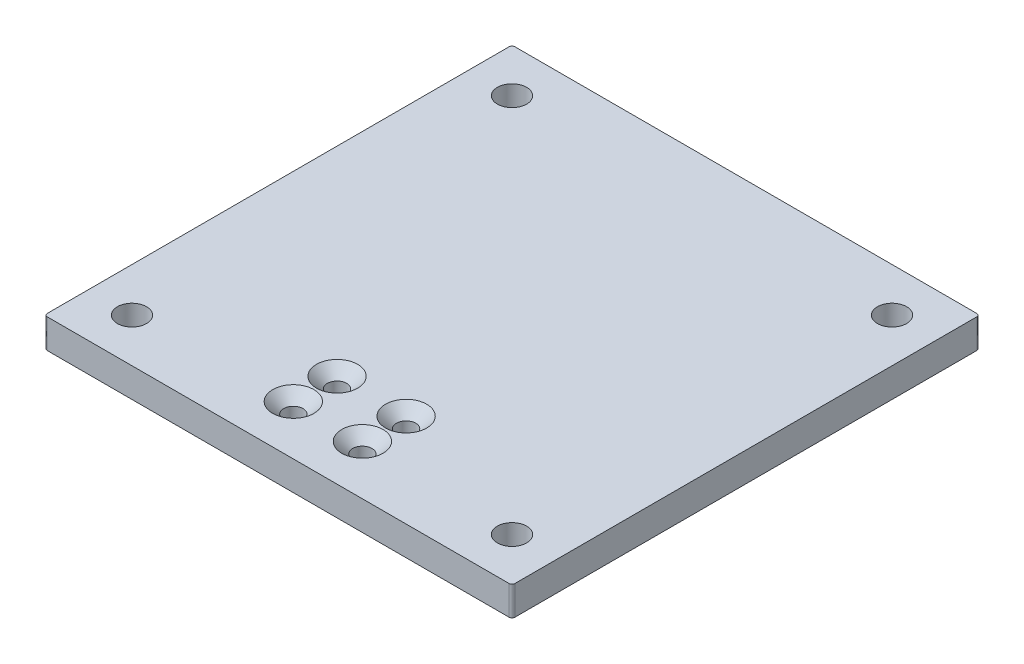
ISO-10303-21;
HEADER;
FILE_DESCRIPTION(('STEP AP214'),'2;1');
FILE_NAME('part.step','',(''),(''),'','','');
FILE_SCHEMA(('AUTOMOTIVE_DESIGN { 1 0 10303 214 1 1 1 1 }'));
ENDSEC;
DATA;
#1=APPLICATION_CONTEXT('core data for automotive mechanical design processes');
#2=APPLICATION_PROTOCOL_DEFINITION('international standard','automotive_design',2000,#1);
#3=PRODUCT_CONTEXT('',#1,'mechanical');
#4=PRODUCT('Part','Part','',(#3));
#5=PRODUCT_RELATED_PRODUCT_CATEGORY('part','',(#4));
#6=PRODUCT_DEFINITION_FORMATION('','',#4);
#7=PRODUCT_DEFINITION_CONTEXT('part definition',#1,'design');
#8=PRODUCT_DEFINITION('design','',#6,#7);
#9=PRODUCT_DEFINITION_SHAPE('','',#8);
#10=(LENGTH_UNIT() NAMED_UNIT(*) SI_UNIT(.MILLI.,.METRE.));
#11=(NAMED_UNIT(*) PLANE_ANGLE_UNIT() SI_UNIT($,.RADIAN.));
#12=(NAMED_UNIT(*) SI_UNIT($,.STERADIAN.) SOLID_ANGLE_UNIT());
#13=UNCERTAINTY_MEASURE_WITH_UNIT(LENGTH_MEASURE(1.E-05),#10,'distance_accuracy_value','');
#14=(GEOMETRIC_REPRESENTATION_CONTEXT(3) GLOBAL_UNCERTAINTY_ASSIGNED_CONTEXT((#13)) GLOBAL_UNIT_ASSIGNED_CONTEXT((#10,
#11,#12)) REPRESENTATION_CONTEXT('',''));
#15=CARTESIAN_POINT('',(0.,0.,0.));
#16=DIRECTION('',(0.,0.,1.));
#17=DIRECTION('',(1.,0.,0.));
#18=AXIS2_PLACEMENT_3D('',#15,#16,#17);
#19=CARTESIAN_POINT('',(101.6,12.7,101.6));
#20=DIRECTION('',(0.,1.,0.));
#21=DIRECTION('',(0.,0.,1.));
#22=AXIS2_PLACEMENT_3D('',#19,#20,#21);
#23=PLANE('',#22);
#24=CARTESIAN_POINT('',(15.,12.7,80.));
#25=DIRECTION('',(0.,1.,0.));
#26=DIRECTION('',(0.,0.,1.));
#27=AXIS2_PLACEMENT_3D('',#24,#25,#26);
#28=CIRCLE('',#27,8.96);
#29=CARTESIAN_POINT('',(15.,12.7,88.96));
#30=VERTEX_POINT('',#29);
#31=EDGE_CURVE('E234',#30,#30,#28,.T.);
#32=ORIENTED_EDGE('',*,*,#31,.F.);
#33=EDGE_LOOP('',(#32));
#34=FACE_BOUND('',#33,.T.);
#35=CARTESIAN_POINT('',(15.,12.7,61.));
#36=DIRECTION('',(0.,1.,0.));
#37=DIRECTION('',(0.,0.,1.));
#38=AXIS2_PLACEMENT_3D('',#35,#36,#37);
#39=CIRCLE('',#38,8.96);
#40=CARTESIAN_POINT('',(15.,12.7,69.96));
#41=VERTEX_POINT('',#40);
#42=EDGE_CURVE('E225',#41,#41,#39,.T.);
#43=ORIENTED_EDGE('',*,*,#42,.F.);
#44=EDGE_LOOP('',(#43));
#45=FACE_BOUND('',#44,.T.);
#46=CARTESIAN_POINT('',(-15.,12.7,80.));
#47=DIRECTION('',(0.,1.,0.));
#48=DIRECTION('',(0.,0.,1.));
#49=AXIS2_PLACEMENT_3D('',#46,#47,#48);
#50=CIRCLE('',#49,8.96);
#51=CARTESIAN_POINT('',(-15.,12.7,88.96));
#52=VERTEX_POINT('',#51);
#53=EDGE_CURVE('E216',#52,#52,#50,.T.);
#54=ORIENTED_EDGE('',*,*,#53,.F.);
#55=EDGE_LOOP('',(#54));
#56=FACE_BOUND('',#55,.T.);
#57=CARTESIAN_POINT('',(-15.,12.7,61.));
#58=DIRECTION('',(0.,1.,0.));
#59=DIRECTION('',(0.,0.,1.));
#60=AXIS2_PLACEMENT_3D('',#57,#58,#59);
#61=CIRCLE('',#60,8.96);
#62=CARTESIAN_POINT('',(-15.,12.7,69.96));
#63=VERTEX_POINT('',#62);
#64=EDGE_CURVE('E207',#63,#63,#61,.T.);
#65=ORIENTED_EDGE('',*,*,#64,.F.);
#66=EDGE_LOOP('',(#65));
#67=FACE_BOUND('',#66,.T.);
#68=CARTESIAN_POINT('',(82.5500000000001,12.7,82.55));
#69=DIRECTION('',(0.,1.,0.));
#70=DIRECTION('',(0.,0.,1.));
#71=AXIS2_PLACEMENT_3D('',#68,#69,#70);
#72=CIRCLE('',#71,6.34999999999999);
#73=CARTESIAN_POINT('',(82.5500000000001,12.7,88.9));
#74=VERTEX_POINT('',#73);
#75=EDGE_CURVE('E187',#74,#74,#72,.T.);
#76=ORIENTED_EDGE('',*,*,#75,.F.);
#77=EDGE_LOOP('',(#76));
#78=FACE_BOUND('',#77,.T.);
#79=CARTESIAN_POINT('',(-82.55,12.7,-82.55));
#80=DIRECTION('',(0.,1.,0.));
#81=DIRECTION('',(0.,0.,1.));
#82=AXIS2_PLACEMENT_3D('',#79,#80,#81);
#83=CIRCLE('',#82,6.34999999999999);
#84=CARTESIAN_POINT('',(-82.55,12.7,-76.2));
#85=VERTEX_POINT('',#84);
#86=EDGE_CURVE('E177',#85,#85,#83,.T.);
#87=ORIENTED_EDGE('',*,*,#86,.F.);
#88=EDGE_LOOP('',(#87));
#89=FACE_BOUND('',#88,.T.);
#90=DIRECTION('',(-1.,0.,0.));
#91=VECTOR('',#90,1.);
#92=CARTESIAN_POINT('',(-101.6,12.7,-101.6));
#93=LINE('',#92,#91);
#94=CARTESIAN_POINT('',(100.33,12.7,-101.6));
#95=VERTEX_POINT('',#94);
#96=CARTESIAN_POINT('',(-100.33,12.7,-101.6));
#97=VERTEX_POINT('',#96);
#98=EDGE_CURVE('E168',#95,#97,#93,.T.);
#99=ORIENTED_EDGE('',*,*,#98,.T.);
#100=CARTESIAN_POINT('',(-100.33,12.7,-100.33));
#101=DIRECTION('',(0.,1.,0.));
#102=DIRECTION('',(0.,0.,1.));
#103=AXIS2_PLACEMENT_3D('',#100,#101,#102);
#104=CIRCLE('',#103,1.27);
#105=CARTESIAN_POINT('',(-101.6,12.7,-100.33));
#106=VERTEX_POINT('',#105);
#107=EDGE_CURVE('E146',#97,#106,#104,.T.);
#108=ORIENTED_EDGE('',*,*,#107,.T.);
#109=DIRECTION('',(0.,0.,1.));
#110=VECTOR('',#109,1.);
#111=CARTESIAN_POINT('',(-101.6,12.7,-101.6));
#112=LINE('',#111,#110);
#113=CARTESIAN_POINT('',(-101.6,12.7,100.33));
#114=VERTEX_POINT('',#113);
#115=EDGE_CURVE('E116',#106,#114,#112,.T.);
#116=ORIENTED_EDGE('',*,*,#115,.T.);
#117=CARTESIAN_POINT('',(-100.33,12.7,100.33));
#118=DIRECTION('',(0.,1.,0.));
#119=DIRECTION('',(0.,0.,1.));
#120=AXIS2_PLACEMENT_3D('',#117,#118,#119);
#121=CIRCLE('',#120,1.27);
#122=CARTESIAN_POINT('',(-100.33,12.7,101.6));
#123=VERTEX_POINT('',#122);
#124=EDGE_CURVE('E52',#114,#123,#121,.T.);
#125=ORIENTED_EDGE('',*,*,#124,.T.);
#126=DIRECTION('',(1.,0.,0.));
#127=VECTOR('',#126,1.);
#128=CARTESIAN_POINT('',(-101.6,12.7,101.6));
#129=LINE('',#128,#127);
#130=CARTESIAN_POINT('',(100.33,12.7,101.6));
#131=VERTEX_POINT('',#130);
#132=EDGE_CURVE('E132',#123,#131,#129,.T.);
#133=ORIENTED_EDGE('',*,*,#132,.T.);
#134=CARTESIAN_POINT('',(100.33,12.7,100.33));
#135=DIRECTION('',(0.,1.,0.));
#136=DIRECTION('',(0.,0.,1.));
#137=AXIS2_PLACEMENT_3D('',#134,#135,#136);
#138=CIRCLE('',#137,1.27);
#139=CARTESIAN_POINT('',(101.6,12.7,100.33));
#140=VERTEX_POINT('',#139);
#141=EDGE_CURVE('E142',#131,#140,#138,.T.);
#142=ORIENTED_EDGE('',*,*,#141,.T.);
#143=DIRECTION('',(0.,0.,-1.));
#144=VECTOR('',#143,1.);
#145=CARTESIAN_POINT('',(101.6,12.7,-101.6));
#146=LINE('',#145,#144);
#147=CARTESIAN_POINT('',(101.6,12.7,-100.33));
#148=VERTEX_POINT('',#147);
#149=EDGE_CURVE('E126',#140,#148,#146,.T.);
#150=ORIENTED_EDGE('',*,*,#149,.T.);
#151=CARTESIAN_POINT('',(100.33,12.7,-100.33));
#152=DIRECTION('',(0.,1.,0.));
#153=DIRECTION('',(0.,0.,1.));
#154=AXIS2_PLACEMENT_3D('',#151,#152,#153);
#155=CIRCLE('',#154,1.27);
#156=EDGE_CURVE('E144',#148,#95,#155,.T.);
#157=ORIENTED_EDGE('',*,*,#156,.T.);
#158=EDGE_LOOP('',(#99,#108,#116,#125,#133,#142,#150,#157));
#159=FACE_BOUND('',#158,.T.);
#160=CARTESIAN_POINT('',(-82.55,12.7,82.55));
#161=DIRECTION('',(0.,1.,0.));
#162=DIRECTION('',(0.,0.,-1.));
#163=AXIS2_PLACEMENT_3D('',#160,#161,#162);
#164=CIRCLE('',#163,6.34999999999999);
#165=CARTESIAN_POINT('',(-82.55,12.7,76.2));
#166=VERTEX_POINT('',#165);
#167=EDGE_CURVE('E182',#166,#166,#164,.T.);
#168=ORIENTED_EDGE('',*,*,#167,.F.);
#169=EDGE_LOOP('',(#168));
#170=FACE_BOUND('',#169,.T.);
#171=CARTESIAN_POINT('',(82.5500000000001,12.7,-82.55));
#172=DIRECTION('',(0.,1.,0.));
#173=DIRECTION('',(0.,0.,-1.));
#174=AXIS2_PLACEMENT_3D('',#171,#172,#173);
#175=CIRCLE('',#174,6.34999999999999);
#176=CARTESIAN_POINT('',(82.5500000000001,12.7,-88.9));
#177=VERTEX_POINT('',#176);
#178=EDGE_CURVE('E193',#177,#177,#175,.T.);
#179=ORIENTED_EDGE('',*,*,#178,.F.);
#180=EDGE_LOOP('',(#179));
#181=FACE_BOUND('',#180,.T.);
#182=ADVANCED_FACE('F32',(#34,#45,#56,#67,#78,#89,#159,#170,#181),#23,.T.);
#183=CARTESIAN_POINT('',(101.6,0.,101.6));
#184=DIRECTION('',(0.,1.,0.));
#185=DIRECTION('',(0.,0.,1.));
#186=AXIS2_PLACEMENT_3D('',#183,#184,#185);
#187=PLANE('',#186);
#188=CARTESIAN_POINT('',(15.,0.,80.));
#189=DIRECTION('',(0.,1.,0.));
#190=DIRECTION('',(0.,0.,1.));
#191=AXIS2_PLACEMENT_3D('',#188,#189,#190);
#192=CIRCLE('',#191,4.2);
#193=CARTESIAN_POINT('',(15.,0.,84.2));
#194=VERTEX_POINT('',#193);
#195=EDGE_CURVE('E228',#194,#194,#192,.T.);
#196=ORIENTED_EDGE('',*,*,#195,.T.);
#197=EDGE_LOOP('',(#196));
#198=FACE_BOUND('',#197,.T.);
#199=CARTESIAN_POINT('',(15.,0.,61.));
#200=DIRECTION('',(0.,1.,0.));
#201=DIRECTION('',(0.,0.,1.));
#202=AXIS2_PLACEMENT_3D('',#199,#200,#201);
#203=CIRCLE('',#202,4.2);
#204=CARTESIAN_POINT('',(15.,0.,65.2));
#205=VERTEX_POINT('',#204);
#206=EDGE_CURVE('E219',#205,#205,#203,.T.);
#207=ORIENTED_EDGE('',*,*,#206,.T.);
#208=EDGE_LOOP('',(#207));
#209=FACE_BOUND('',#208,.T.);
#210=CARTESIAN_POINT('',(-15.,0.,80.));
#211=DIRECTION('',(0.,1.,0.));
#212=DIRECTION('',(0.,0.,1.));
#213=AXIS2_PLACEMENT_3D('',#210,#211,#212);
#214=CIRCLE('',#213,4.2);
#215=CARTESIAN_POINT('',(-15.,0.,84.2));
#216=VERTEX_POINT('',#215);
#217=EDGE_CURVE('E210',#216,#216,#214,.T.);
#218=ORIENTED_EDGE('',*,*,#217,.T.);
#219=EDGE_LOOP('',(#218));
#220=FACE_BOUND('',#219,.T.);
#221=CARTESIAN_POINT('',(-15.,0.,61.));
#222=DIRECTION('',(0.,1.,0.));
#223=DIRECTION('',(0.,0.,1.));
#224=AXIS2_PLACEMENT_3D('',#221,#222,#223);
#225=CIRCLE('',#224,4.2);
#226=CARTESIAN_POINT('',(-15.,0.,65.2));
#227=VERTEX_POINT('',#226);
#228=EDGE_CURVE('E199',#227,#227,#225,.T.);
#229=ORIENTED_EDGE('',*,*,#228,.T.);
#230=EDGE_LOOP('',(#229));
#231=FACE_BOUND('',#230,.T.);
#232=CARTESIAN_POINT('',(82.5500000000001,0.,82.55));
#233=DIRECTION('',(0.,1.,0.));
#234=DIRECTION('',(0.,0.,1.));
#235=AXIS2_PLACEMENT_3D('',#232,#233,#234);
#236=CIRCLE('',#235,6.34999999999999);
#237=CARTESIAN_POINT('',(82.5500000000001,0.,88.9));
#238=VERTEX_POINT('',#237);
#239=EDGE_CURVE('E190',#238,#238,#236,.T.);
#240=ORIENTED_EDGE('',*,*,#239,.T.);
#241=EDGE_LOOP('',(#240));
#242=FACE_BOUND('',#241,.T.);
#243=CARTESIAN_POINT('',(-82.55,0.,-82.55));
#244=DIRECTION('',(0.,1.,0.));
#245=DIRECTION('',(0.,0.,1.));
#246=AXIS2_PLACEMENT_3D('',#243,#244,#245);
#247=CIRCLE('',#246,6.34999999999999);
#248=CARTESIAN_POINT('',(-82.55,0.,-76.2));
#249=VERTEX_POINT('',#248);
#250=EDGE_CURVE('E173',#249,#249,#247,.T.);
#251=ORIENTED_EDGE('',*,*,#250,.T.);
#252=EDGE_LOOP('',(#251));
#253=FACE_BOUND('',#252,.T.);
#254=DIRECTION('',(0.,0.,1.));
#255=VECTOR('',#254,1.);
#256=CARTESIAN_POINT('',(-101.6,0.,-101.6));
#257=LINE('',#256,#255);
#258=CARTESIAN_POINT('',(-101.6,0.,-100.33));
#259=VERTEX_POINT('',#258);
#260=CARTESIAN_POINT('',(-101.6,0.,100.33));
#261=VERTEX_POINT('',#260);
#262=EDGE_CURVE('E114',#259,#261,#257,.T.);
#263=ORIENTED_EDGE('',*,*,#262,.F.);
#264=CARTESIAN_POINT('',(-100.33,0.,-100.33));
#265=DIRECTION('',(0.,1.,0.));
#266=DIRECTION('',(0.,0.,1.));
#267=AXIS2_PLACEMENT_3D('',#264,#265,#266);
#268=CIRCLE('',#267,1.27);
#269=CARTESIAN_POINT('',(-100.33,0.,-101.6));
#270=VERTEX_POINT('',#269);
#271=EDGE_CURVE('E97',#259,#270,#268,.F.);
#272=ORIENTED_EDGE('',*,*,#271,.T.);
#273=DIRECTION('',(-1.,0.,0.));
#274=VECTOR('',#273,1.);
#275=CARTESIAN_POINT('',(-101.6,0.,-101.6));
#276=LINE('',#275,#274);
#277=CARTESIAN_POINT('',(100.33,0.,-101.6));
#278=VERTEX_POINT('',#277);
#279=EDGE_CURVE('E124',#278,#270,#276,.T.);
#280=ORIENTED_EDGE('',*,*,#279,.F.);
#281=CARTESIAN_POINT('',(100.33,0.,-100.33));
#282=DIRECTION('',(0.,1.,0.));
#283=DIRECTION('',(0.,0.,1.));
#284=AXIS2_PLACEMENT_3D('',#281,#282,#283);
#285=CIRCLE('',#284,1.27);
#286=CARTESIAN_POINT('',(101.6,0.,-100.33));
#287=VERTEX_POINT('',#286);
#288=EDGE_CURVE('E108',#278,#287,#285,.F.);
#289=ORIENTED_EDGE('',*,*,#288,.T.);
#290=DIRECTION('',(0.,0.,-1.));
#291=VECTOR('',#290,1.);
#292=CARTESIAN_POINT('',(101.6,0.,-101.6));
#293=LINE('',#292,#291);
#294=CARTESIAN_POINT('',(101.6,0.,100.33));
#295=VERTEX_POINT('',#294);
#296=EDGE_CURVE('E128',#295,#287,#293,.T.);
#297=ORIENTED_EDGE('',*,*,#296,.F.);
#298=CARTESIAN_POINT('',(100.33,0.,100.33));
#299=DIRECTION('',(0.,1.,0.));
#300=DIRECTION('',(0.,0.,1.));
#301=AXIS2_PLACEMENT_3D('',#298,#299,#300);
#302=CIRCLE('',#301,1.27);
#303=CARTESIAN_POINT('',(100.33,0.,101.6));
#304=VERTEX_POINT('',#303);
#305=EDGE_CURVE('E135',#295,#304,#302,.F.);
#306=ORIENTED_EDGE('',*,*,#305,.T.);
#307=DIRECTION('',(1.,0.,0.));
#308=VECTOR('',#307,1.);
#309=CARTESIAN_POINT('',(-101.6,0.,101.6));
#310=LINE('',#309,#308);
#311=CARTESIAN_POINT('',(-100.33,0.,101.6));
#312=VERTEX_POINT('',#311);
#313=EDGE_CURVE('E123',#312,#304,#310,.T.);
#314=ORIENTED_EDGE('',*,*,#313,.F.);
#315=CARTESIAN_POINT('',(-100.33,0.,100.33));
#316=DIRECTION('',(0.,1.,0.));
#317=DIRECTION('',(0.,0.,1.));
#318=AXIS2_PLACEMENT_3D('',#315,#316,#317);
#319=CIRCLE('',#318,1.27);
#320=EDGE_CURVE('E117',#312,#261,#319,.F.);
#321=ORIENTED_EDGE('',*,*,#320,.T.);
#322=EDGE_LOOP('',(#263,#272,#280,#289,#297,#306,#314,#321));
#323=FACE_BOUND('',#322,.T.);
#324=CARTESIAN_POINT('',(-82.55,0.,82.55));
#325=DIRECTION('',(0.,1.,0.));
#326=DIRECTION('',(0.,0.,-1.));
#327=AXIS2_PLACEMENT_3D('',#324,#325,#326);
#328=CIRCLE('',#327,6.34999999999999);
#329=CARTESIAN_POINT('',(-82.55,0.,76.2));
#330=VERTEX_POINT('',#329);
#331=EDGE_CURVE('E184',#330,#330,#328,.T.);
#332=ORIENTED_EDGE('',*,*,#331,.T.);
#333=EDGE_LOOP('',(#332));
#334=FACE_BOUND('',#333,.T.);
#335=CARTESIAN_POINT('',(82.5500000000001,0.,-82.55));
#336=DIRECTION('',(0.,1.,0.));
#337=DIRECTION('',(0.,0.,-1.));
#338=AXIS2_PLACEMENT_3D('',#335,#336,#337);
#339=CIRCLE('',#338,6.34999999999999);
#340=CARTESIAN_POINT('',(82.5500000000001,0.,-88.9));
#341=VERTEX_POINT('',#340);
#342=EDGE_CURVE('E196',#341,#341,#339,.T.);
#343=ORIENTED_EDGE('',*,*,#342,.T.);
#344=EDGE_LOOP('',(#343));
#345=FACE_BOUND('',#344,.T.);
#346=ADVANCED_FACE('F120',(#198,#209,#220,#231,#242,#253,#323,#334,#345),#187,.F.);
#347=CARTESIAN_POINT('',(101.6,12.7,-101.6));
#348=DIRECTION('',(-1.,0.,0.));
#349=DIRECTION('',(0.,0.,1.));
#350=AXIS2_PLACEMENT_3D('',#347,#348,#349);
#351=PLANE('',#350);
#352=ORIENTED_EDGE('',*,*,#296,.T.);
#353=DIRECTION('',(0.,-1.,0.));
#354=VECTOR('',#353,1.);
#355=CARTESIAN_POINT('',(101.6,12.7,-100.33));
#356=LINE('',#355,#354);
#357=EDGE_CURVE('E151',#287,#148,#356,.F.);
#358=ORIENTED_EDGE('',*,*,#357,.T.);
#359=ORIENTED_EDGE('',*,*,#149,.F.);
#360=DIRECTION('',(0.,-1.,0.));
#361=VECTOR('',#360,1.);
#362=CARTESIAN_POINT('',(101.6,12.7,100.33));
#363=LINE('',#362,#361);
#364=EDGE_CURVE('E148',#140,#295,#363,.T.);
#365=ORIENTED_EDGE('',*,*,#364,.T.);
#366=EDGE_LOOP('',(#352,#358,#359,#365));
#367=FACE_BOUND('',#366,.T.);
#368=ADVANCED_FACE('F164',(#367),#351,.F.);
#369=CARTESIAN_POINT('',(-101.6,12.7,-101.6));
#370=DIRECTION('',(0.,0.,1.));
#371=DIRECTION('',(1.,0.,0.));
#372=AXIS2_PLACEMENT_3D('',#369,#370,#371);
#373=PLANE('',#372);
#374=ORIENTED_EDGE('',*,*,#279,.T.);
#375=DIRECTION('',(0.,-1.,0.));
#376=VECTOR('',#375,1.);
#377=CARTESIAN_POINT('',(-100.33,12.7,-101.6));
#378=LINE('',#377,#376);
#379=EDGE_CURVE('E102',#270,#97,#378,.F.);
#380=ORIENTED_EDGE('',*,*,#379,.T.);
#381=ORIENTED_EDGE('',*,*,#98,.F.);
#382=DIRECTION('',(0.,-1.,0.));
#383=VECTOR('',#382,1.);
#384=CARTESIAN_POINT('',(100.33,12.7,-101.6));
#385=LINE('',#384,#383);
#386=EDGE_CURVE('E107',#95,#278,#385,.T.);
#387=ORIENTED_EDGE('',*,*,#386,.T.);
#388=EDGE_LOOP('',(#374,#380,#381,#387));
#389=FACE_BOUND('',#388,.T.);
#390=ADVANCED_FACE('F271',(#389),#373,.F.);
#391=CARTESIAN_POINT('',(-101.6,12.7,-101.6));
#392=DIRECTION('',(1.,0.,0.));
#393=DIRECTION('',(0.,0.,-1.));
#394=AXIS2_PLACEMENT_3D('',#391,#392,#393);
#395=PLANE('',#394);
#396=ORIENTED_EDGE('',*,*,#115,.F.);
#397=DIRECTION('',(0.,-1.,0.));
#398=VECTOR('',#397,1.);
#399=CARTESIAN_POINT('',(-101.6,12.7,-100.33));
#400=LINE('',#399,#398);
#401=EDGE_CURVE('E101',#106,#259,#400,.T.);
#402=ORIENTED_EDGE('',*,*,#401,.T.);
#403=ORIENTED_EDGE('',*,*,#262,.T.);
#404=DIRECTION('',(0.,-1.,0.));
#405=VECTOR('',#404,1.);
#406=CARTESIAN_POINT('',(-101.6,12.7,100.33));
#407=LINE('',#406,#405);
#408=EDGE_CURVE('E118',#261,#114,#407,.F.);
#409=ORIENTED_EDGE('',*,*,#408,.T.);
#410=EDGE_LOOP('',(#396,#402,#403,#409));
#411=FACE_BOUND('',#410,.T.);
#412=ADVANCED_FACE('F113',(#411),#395,.F.);
#413=CARTESIAN_POINT('',(-101.6,12.7,101.6));
#414=DIRECTION('',(0.,0.,-1.));
#415=DIRECTION('',(-1.,0.,0.));
#416=AXIS2_PLACEMENT_3D('',#413,#414,#415);
#417=PLANE('',#416);
#418=ORIENTED_EDGE('',*,*,#313,.T.);
#419=DIRECTION('',(0.,-1.,0.));
#420=VECTOR('',#419,1.);
#421=CARTESIAN_POINT('',(100.33,12.7,101.6));
#422=LINE('',#421,#420);
#423=EDGE_CURVE('E11',#304,#131,#422,.F.);
#424=ORIENTED_EDGE('',*,*,#423,.T.);
#425=ORIENTED_EDGE('',*,*,#132,.F.);
#426=DIRECTION('',(0.,-1.,0.));
#427=VECTOR('',#426,1.);
#428=CARTESIAN_POINT('',(-100.33,12.7,101.6));
#429=LINE('',#428,#427);
#430=EDGE_CURVE('E40',#123,#312,#429,.T.);
#431=ORIENTED_EDGE('',*,*,#430,.T.);
#432=EDGE_LOOP('',(#418,#424,#425,#431));
#433=FACE_BOUND('',#432,.T.);
#434=ADVANCED_FACE('F154',(#433),#417,.F.);
#435=CARTESIAN_POINT('',(-82.55,12.7,-82.55));
#436=DIRECTION('',(0.,-1.,0.));
#437=DIRECTION('',(0.,0.,-1.));
#438=AXIS2_PLACEMENT_3D('',#435,#436,#437);
#439=CYLINDRICAL_SURFACE('',#438,6.34999999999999);
#440=ORIENTED_EDGE('',*,*,#86,.T.);
#441=EDGE_LOOP('',(#440));
#442=FACE_BOUND('',#441,.T.);
#443=ORIENTED_EDGE('',*,*,#250,.F.);
#444=EDGE_LOOP('',(#443));
#445=FACE_BOUND('',#444,.T.);
#446=ADVANCED_FACE('F278',(#442,#445),#439,.F.);
#447=CARTESIAN_POINT('',(-82.55,12.7,82.55));
#448=DIRECTION('',(0.,-1.,0.));
#449=DIRECTION('',(0.,0.,-1.));
#450=AXIS2_PLACEMENT_3D('',#447,#448,#449);
#451=CYLINDRICAL_SURFACE('',#450,6.34999999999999);
#452=ORIENTED_EDGE('',*,*,#167,.T.);
#453=EDGE_LOOP('',(#452));
#454=FACE_BOUND('',#453,.T.);
#455=ORIENTED_EDGE('',*,*,#331,.F.);
#456=EDGE_LOOP('',(#455));
#457=FACE_BOUND('',#456,.T.);
#458=ADVANCED_FACE('F440',(#454,#457),#451,.F.);
#459=CARTESIAN_POINT('',(82.5500000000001,12.7,82.55));
#460=DIRECTION('',(0.,-1.,0.));
#461=DIRECTION('',(0.,0.,-1.));
#462=AXIS2_PLACEMENT_3D('',#459,#460,#461);
#463=CYLINDRICAL_SURFACE('',#462,6.34999999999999);
#464=ORIENTED_EDGE('',*,*,#75,.T.);
#465=EDGE_LOOP('',(#464));
#466=FACE_BOUND('',#465,.T.);
#467=ORIENTED_EDGE('',*,*,#239,.F.);
#468=EDGE_LOOP('',(#467));
#469=FACE_BOUND('',#468,.T.);
#470=ADVANCED_FACE('F261',(#466,#469),#463,.F.);
#471=CARTESIAN_POINT('',(82.5500000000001,12.7,-82.55));
#472=DIRECTION('',(0.,-1.,0.));
#473=DIRECTION('',(0.,0.,-1.));
#474=AXIS2_PLACEMENT_3D('',#471,#472,#473);
#475=CYLINDRICAL_SURFACE('',#474,6.34999999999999);
#476=ORIENTED_EDGE('',*,*,#178,.T.);
#477=EDGE_LOOP('',(#476));
#478=FACE_BOUND('',#477,.T.);
#479=ORIENTED_EDGE('',*,*,#342,.F.);
#480=EDGE_LOOP('',(#479));
#481=FACE_BOUND('',#480,.T.);
#482=ADVANCED_FACE('F257',(#478,#481),#475,.F.);
#483=CARTESIAN_POINT('',(-15.,12.7,61.));
#484=DIRECTION('',(0.,1.,0.));
#485=DIRECTION('',(0.,0.,1.));
#486=AXIS2_PLACEMENT_3D('',#483,#484,#485);
#487=CYLINDRICAL_SURFACE('',#486,4.2);
#488=ORIENTED_EDGE('',*,*,#228,.F.);
#489=EDGE_LOOP('',(#488));
#490=FACE_BOUND('',#489,.T.);
#491=CARTESIAN_POINT('',(-15.,7.94,61.));
#492=DIRECTION('',(0.,1.,0.));
#493=DIRECTION('',(0.,0.,1.));
#494=AXIS2_PLACEMENT_3D('',#491,#492,#493);
#495=CIRCLE('',#494,4.2);
#496=CARTESIAN_POINT('',(-15.,7.94,65.2));
#497=VERTEX_POINT('',#496);
#498=EDGE_CURVE('E204',#497,#497,#495,.T.);
#499=ORIENTED_EDGE('',*,*,#498,.T.);
#500=EDGE_LOOP('',(#499));
#501=FACE_BOUND('',#500,.T.);
#502=ADVANCED_FACE('F260',(#490,#501),#487,.F.);
#503=CARTESIAN_POINT('',(-15.,12.7,61.));
#504=DIRECTION('',(0.,1.,0.));
#505=DIRECTION('',(0.,0.,1.));
#506=AXIS2_PLACEMENT_3D('',#503,#504,#505);
#507=CONICAL_SURFACE('',#506,8.96,0.785398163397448);
#508=ORIENTED_EDGE('',*,*,#498,.F.);
#509=EDGE_LOOP('',(#508));
#510=FACE_BOUND('',#509,.T.);
#511=ORIENTED_EDGE('',*,*,#64,.T.);
#512=EDGE_LOOP('',(#511));
#513=FACE_BOUND('',#512,.T.);
#514=ADVANCED_FACE('F406',(#510,#513),#507,.F.);
#515=CARTESIAN_POINT('',(-15.,12.7,80.));
#516=DIRECTION('',(0.,1.,0.));
#517=DIRECTION('',(0.,0.,1.));
#518=AXIS2_PLACEMENT_3D('',#515,#516,#517);
#519=CYLINDRICAL_SURFACE('',#518,4.2);
#520=ORIENTED_EDGE('',*,*,#217,.F.);
#521=EDGE_LOOP('',(#520));
#522=FACE_BOUND('',#521,.T.);
#523=CARTESIAN_POINT('',(-15.,7.94,80.));
#524=DIRECTION('',(0.,1.,0.));
#525=DIRECTION('',(0.,0.,1.));
#526=AXIS2_PLACEMENT_3D('',#523,#524,#525);
#527=CIRCLE('',#526,4.2);
#528=CARTESIAN_POINT('',(-15.,7.94,84.2));
#529=VERTEX_POINT('',#528);
#530=EDGE_CURVE('E213',#529,#529,#527,.T.);
#531=ORIENTED_EDGE('',*,*,#530,.T.);
#532=EDGE_LOOP('',(#531));
#533=FACE_BOUND('',#532,.T.);
#534=ADVANCED_FACE('F396',(#522,#533),#519,.F.);
#535=CARTESIAN_POINT('',(-15.,12.7,80.));
#536=DIRECTION('',(0.,1.,0.));
#537=DIRECTION('',(0.,0.,1.));
#538=AXIS2_PLACEMENT_3D('',#535,#536,#537);
#539=CONICAL_SURFACE('',#538,8.96,0.785398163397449);
#540=ORIENTED_EDGE('',*,*,#530,.F.);
#541=EDGE_LOOP('',(#540));
#542=FACE_BOUND('',#541,.T.);
#543=ORIENTED_EDGE('',*,*,#53,.T.);
#544=EDGE_LOOP('',(#543));
#545=FACE_BOUND('',#544,.T.);
#546=ADVANCED_FACE('F386',(#542,#545),#539,.F.);
#547=CARTESIAN_POINT('',(15.,12.7,61.));
#548=DIRECTION('',(0.,1.,0.));
#549=DIRECTION('',(0.,0.,1.));
#550=AXIS2_PLACEMENT_3D('',#547,#548,#549);
#551=CYLINDRICAL_SURFACE('',#550,4.2);
#552=ORIENTED_EDGE('',*,*,#206,.F.);
#553=EDGE_LOOP('',(#552));
#554=FACE_BOUND('',#553,.T.);
#555=CARTESIAN_POINT('',(15.,7.94,61.));
#556=DIRECTION('',(0.,1.,0.));
#557=DIRECTION('',(0.,0.,1.));
#558=AXIS2_PLACEMENT_3D('',#555,#556,#557);
#559=CIRCLE('',#558,4.2);
#560=CARTESIAN_POINT('',(15.,7.94,65.2));
#561=VERTEX_POINT('',#560);
#562=EDGE_CURVE('E222',#561,#561,#559,.T.);
#563=ORIENTED_EDGE('',*,*,#562,.T.);
#564=EDGE_LOOP('',(#563));
#565=FACE_BOUND('',#564,.T.);
#566=ADVANCED_FACE('F376',(#554,#565),#551,.F.);
#567=CARTESIAN_POINT('',(15.,12.7,61.));
#568=DIRECTION('',(0.,1.,0.));
#569=DIRECTION('',(0.,0.,1.));
#570=AXIS2_PLACEMENT_3D('',#567,#568,#569);
#571=CONICAL_SURFACE('',#570,8.96,0.785398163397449);
#572=ORIENTED_EDGE('',*,*,#562,.F.);
#573=EDGE_LOOP('',(#572));
#574=FACE_BOUND('',#573,.T.);
#575=ORIENTED_EDGE('',*,*,#42,.T.);
#576=EDGE_LOOP('',(#575));
#577=FACE_BOUND('',#576,.T.);
#578=ADVANCED_FACE('F366',(#574,#577),#571,.F.);
#579=CARTESIAN_POINT('',(15.,12.7,80.));
#580=DIRECTION('',(0.,1.,0.));
#581=DIRECTION('',(0.,0.,1.));
#582=AXIS2_PLACEMENT_3D('',#579,#580,#581);
#583=CYLINDRICAL_SURFACE('',#582,4.2);
#584=ORIENTED_EDGE('',*,*,#195,.F.);
#585=EDGE_LOOP('',(#584));
#586=FACE_BOUND('',#585,.T.);
#587=CARTESIAN_POINT('',(15.,7.94,80.));
#588=DIRECTION('',(0.,1.,0.));
#589=DIRECTION('',(0.,0.,1.));
#590=AXIS2_PLACEMENT_3D('',#587,#588,#589);
#591=CIRCLE('',#590,4.2);
#592=CARTESIAN_POINT('',(15.,7.94,84.2));
#593=VERTEX_POINT('',#592);
#594=EDGE_CURVE('E231',#593,#593,#591,.T.);
#595=ORIENTED_EDGE('',*,*,#594,.T.);
#596=EDGE_LOOP('',(#595));
#597=FACE_BOUND('',#596,.T.);
#598=ADVANCED_FACE('F356',(#586,#597),#583,.F.);
#599=CARTESIAN_POINT('',(15.,12.7,80.));
#600=DIRECTION('',(0.,1.,0.));
#601=DIRECTION('',(0.,0.,1.));
#602=AXIS2_PLACEMENT_3D('',#599,#600,#601);
#603=CONICAL_SURFACE('',#602,8.96,0.785398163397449);
#604=ORIENTED_EDGE('',*,*,#594,.F.);
#605=EDGE_LOOP('',(#604));
#606=FACE_BOUND('',#605,.T.);
#607=ORIENTED_EDGE('',*,*,#31,.T.);
#608=EDGE_LOOP('',(#607));
#609=FACE_BOUND('',#608,.T.);
#610=ADVANCED_FACE('F238',(#606,#609),#603,.F.);
#611=CARTESIAN_POINT('',(-100.33,12.7,-100.33));
#612=DIRECTION('',(0.,-1.,0.));
#613=DIRECTION('',(0.,0.,-1.));
#614=AXIS2_PLACEMENT_3D('',#611,#612,#613);
#615=CYLINDRICAL_SURFACE('',#614,1.27);
#616=ORIENTED_EDGE('',*,*,#107,.F.);
#617=ORIENTED_EDGE('',*,*,#379,.F.);
#618=ORIENTED_EDGE('',*,*,#271,.F.);
#619=ORIENTED_EDGE('',*,*,#401,.F.);
#620=EDGE_LOOP('',(#616,#617,#618,#619));
#621=FACE_BOUND('',#620,.T.);
#622=ADVANCED_FACE('F100',(#621),#615,.T.);
#623=CARTESIAN_POINT('',(100.33,12.7,-100.33));
#624=DIRECTION('',(0.,-1.,0.));
#625=DIRECTION('',(0.,0.,-1.));
#626=AXIS2_PLACEMENT_3D('',#623,#624,#625);
#627=CYLINDRICAL_SURFACE('',#626,1.27);
#628=ORIENTED_EDGE('',*,*,#156,.F.);
#629=ORIENTED_EDGE('',*,*,#357,.F.);
#630=ORIENTED_EDGE('',*,*,#288,.F.);
#631=ORIENTED_EDGE('',*,*,#386,.F.);
#632=EDGE_LOOP('',(#628,#629,#630,#631));
#633=FACE_BOUND('',#632,.T.);
#634=ADVANCED_FACE('F286',(#633),#627,.T.);
#635=CARTESIAN_POINT('',(100.33,12.7,100.33));
#636=DIRECTION('',(0.,-1.,0.));
#637=DIRECTION('',(0.,0.,-1.));
#638=AXIS2_PLACEMENT_3D('',#635,#636,#637);
#639=CYLINDRICAL_SURFACE('',#638,1.27);
#640=ORIENTED_EDGE('',*,*,#141,.F.);
#641=ORIENTED_EDGE('',*,*,#423,.F.);
#642=ORIENTED_EDGE('',*,*,#305,.F.);
#643=ORIENTED_EDGE('',*,*,#364,.F.);
#644=EDGE_LOOP('',(#640,#641,#642,#643));
#645=FACE_BOUND('',#644,.T.);
#646=ADVANCED_FACE('F161',(#645),#639,.T.);
#647=CARTESIAN_POINT('',(-100.33,12.7,100.33));
#648=DIRECTION('',(0.,-1.,0.));
#649=DIRECTION('',(0.,0.,-1.));
#650=AXIS2_PLACEMENT_3D('',#647,#648,#649);
#651=CYLINDRICAL_SURFACE('',#650,1.27);
#652=ORIENTED_EDGE('',*,*,#124,.F.);
#653=ORIENTED_EDGE('',*,*,#408,.F.);
#654=ORIENTED_EDGE('',*,*,#320,.F.);
#655=ORIENTED_EDGE('',*,*,#430,.F.);
#656=EDGE_LOOP('',(#652,#653,#654,#655));
#657=FACE_BOUND('',#656,.T.);
#658=ADVANCED_FACE('F34',(#657),#651,.T.);
#659=CLOSED_SHELL('',(#182,#346,#368,#390,#412,#434,#446,#458,#470,#482,#502,#514,#534,#546,
#566,#578,#598,#610,#622,#634,#646,#658));
#660=MANIFOLD_SOLID_BREP('B2',#659);
#661=ADVANCED_BREP_SHAPE_REPRESENTATION('',(#18,#660),#14);
#662=SHAPE_DEFINITION_REPRESENTATION(#9,#661);
ENDSEC;
END-ISO-10303-21;
